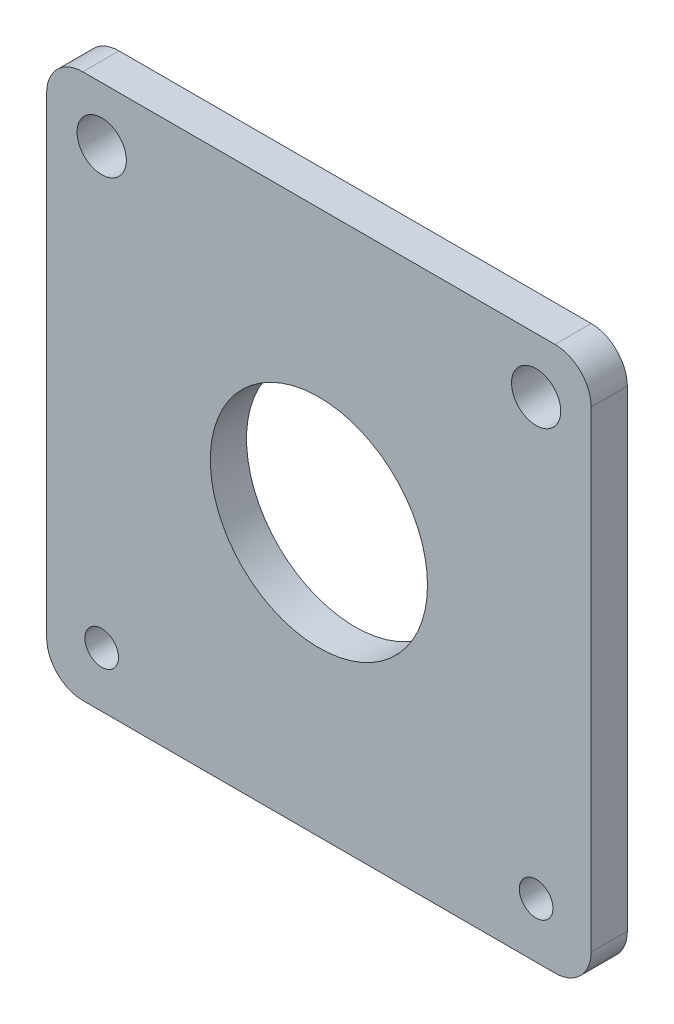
from build123d import *

# Parameters (mm, degrees)
SKETCH1_W      = 47.752
SKETCH1_H      = 47.752
SKETCH1_R      = 9.525
SKETCH1_R_2    = 2.159
SKETCH1_R_3    = 1.4732
EXTRUDE1_DEPTH = 3.175
FILLET1_R      = 3.175


with BuildPart() as part:
    # Sketch1 → Extrude1 (new body)
    with BuildSketch(Plane.XY):
        Rectangle(SKETCH1_W, SKETCH1_H)
        Circle(SKETCH1_R, mode=Mode.SUBTRACT)
        with Locations((19.05, 19.05)):
            Circle(SKETCH1_R_2, mode=Mode.SUBTRACT)
        with Locations(Location((-19.05, 19.05, 0), (0, 0, 180))):
            Circle(SKETCH1_R_2, mode=Mode.SUBTRACT)
        with Locations((19.05, -19.05)):
            Circle(SKETCH1_R_3, mode=Mode.SUBTRACT)
        with Locations(Location((-19.05, -19.05, 0), (0, 0, 180))):
            Circle(SKETCH1_R_3, mode=Mode.SUBTRACT)
    extrude(amount=EXTRUDE1_DEPTH)

    # Fillet1
    fillet1_edges = [part.edges().sort_by_distance(p)[0] for p in [
        (23.876, -23.876, 1.5875),
        (-23.876, -23.876, 1.5875),
        (-23.876, 23.876, 1.5875),
        (23.876, 23.876, 1.5875),
    ]]
    fillet(fillet1_edges, radius=FILLET1_R)


solid = part.part
